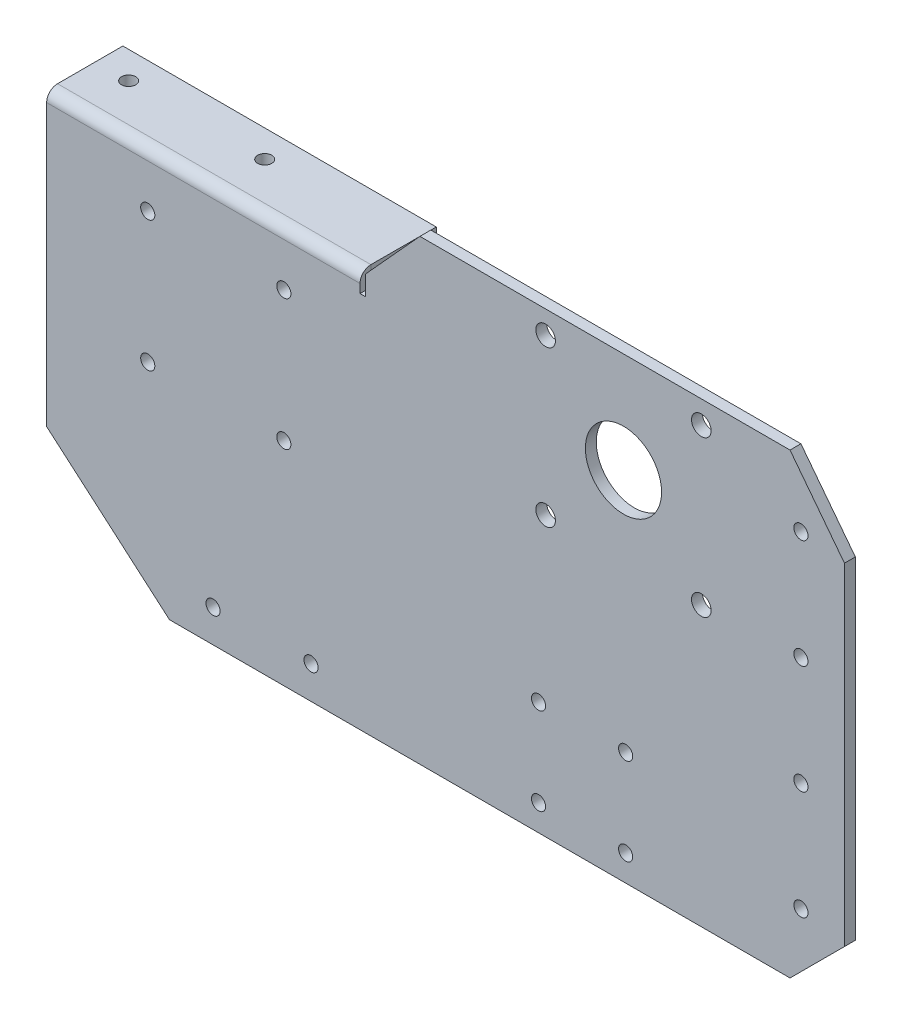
from build123d import *

# Parameters (mm, degrees)
ESQUISSE1_R                  = 6.5
ESQUISSE1_R_2                = 9
ESQUISSE1_R_3                = 35
BASE_EXTRUSION_DEPTH         = 10
BOSS_EXTRU_1_DEPTH           = 10
ESQUISSE3_R                  = 6.5
ENL_V_MAT_EXTRU_1_DEPTH      = 882.375856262
CONG_1_R                     = 10
ENL_V_MAT_EXTRU_2_DEPTH      = 906.537166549
ENL_V_MAT_EXTRU_2_DEPTH_BACK = 906.537166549


with BuildPart() as part:
    # Esquisse1 → Base-Extrusion (new body)
    with BuildSketch(Plane.XY):
        Polygon((749.999, -0.001), (179.999, -0.001), (-0.001, 154.999), (-0.001, 364.999), (354.999, 364.999), (354.999, 346.999), (359.999, 346.999), (359.999, 364.999), (409.999, 419.999), (749.999, 419.999), (799.999, 354.999), (799.999, 49.999), align=None)
        with Locations((759.999, 359.999)):
            Circle(ESQUISSE1_R, mode=Mode.SUBTRACT)
        with Locations((668.499, 398.999)):
            Circle(ESQUISSE1_R_2, mode=Mode.SUBTRACT)
        with Locations((668.499, 255.999)):
            Circle(ESQUISSE1_R_2, mode=Mode.SUBTRACT)
        with Locations((525.499, 398.999)):
            Circle(ESQUISSE1_R_2, mode=Mode.SUBTRACT)
        with Locations((525.499, 255.999)):
            Circle(ESQUISSE1_R_2, mode=Mode.SUBTRACT)
        with Locations((759.999, 259.999)):
            Circle(ESQUISSE1_R, mode=Mode.SUBTRACT)
        with Locations((596.999, 327.499)):
            Circle(ESQUISSE1_R_3, mode=Mode.SUBTRACT)
        with Locations((598.999, 103.999)):
            Circle(ESQUISSE1_R, mode=Mode.SUBTRACT)
        with Locations((598.999, 23.999)):
            Circle(ESQUISSE1_R, mode=Mode.SUBTRACT)
        with Locations((518.999, 103.999)):
            Circle(ESQUISSE1_R, mode=Mode.SUBTRACT)
        with Locations((518.999, 23.999)):
            Circle(ESQUISSE1_R, mode=Mode.SUBTRACT)
        with Locations((309.999, 29.999)):
            Circle(ESQUISSE1_R, mode=Mode.SUBTRACT)
        with Locations((219.999, 29.999)):
            Circle(ESQUISSE1_R, mode=Mode.SUBTRACT)
        with Locations((34.999, 194.999)):
            Circle(ESQUISSE1_R, mode=Mode.SUBTRACT)
        with Locations((159.999, 194.999)):
            Circle(ESQUISSE1_R, mode=Mode.SUBTRACT)
        with Locations((284.999, 194.999)):
            Circle(ESQUISSE1_R, mode=Mode.SUBTRACT)
        with Locations((34.999, 314.999)):
            Circle(ESQUISSE1_R, mode=Mode.SUBTRACT)
        with Locations((159.999, 314.999)):
            Circle(ESQUISSE1_R, mode=Mode.SUBTRACT)
        with Locations((284.999, 314.999)):
            Circle(ESQUISSE1_R, mode=Mode.SUBTRACT)
        with Locations((759.999, 159.999)):
            Circle(ESQUISSE1_R, mode=Mode.SUBTRACT)
        with Locations((759.999, 59.999)):
            Circle(ESQUISSE1_R, mode=Mode.SUBTRACT)
    extrude(amount=BASE_EXTRUSION_DEPTH)

    # Esquisse2 → Boss.-Extru.1 (add)
    with BuildSketch(Plane(origin=(0, 364.999, 0), x_dir=(-1, 0, 0), z_dir=(0, 1, 0))):
        Polygon((-354.961758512, 10), (0.065076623, 10), (0.065076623, -60), (-355.074197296, -60), align=None)
    extrude(amount=-BOSS_EXTRU_1_DEPTH)

    # Esquisse3 → Enl_v. mat.-Extru.1 (cut, through all)
    with BuildSketch(Plane(origin=(0, 364.999, 0), x_dir=(-1, 0, 0), z_dir=(0, 1, 0))):
        with Locations((-97.434923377, -35)):
            Circle(ESQUISSE3_R)
        with Locations((-222.434923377, -35)):
            Circle(ESQUISSE3_R)
    extrude(amount=-ENL_V_MAT_EXTRU_1_DEPTH, mode=Mode.SUBTRACT)

    # Cong_1
    cong_1_edges = [part.edges().sort_by_distance(p)[0] for p in [
        (177.488410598, 354.999, 0),
        (177.466961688, 364.999, 10),
    ]]
    fillet(cong_1_edges, radius=CONG_1_R)

    # Esquisse6 → Enl_v. mat.-Extru.2 (cut, two sides: drawn at the far end of the back side and taken through both)
    with BuildSketch(Plane(origin=(0, 0, 0), x_dir=(-1, 0, 0), z_dir=(0, 0, -1)).offset(-ENL_V_MAT_EXTRU_2_DEPTH_BACK)):
        Polygon((-1757.463619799, 879.229650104), (-64.499, 459.303132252), (26.463129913, 436.740693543), (26.463129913, 111.841576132), (-67.142826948, 97.180704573), (-67.142826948, 459.303132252), (-67.142826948, 2203.57016579), (-2218.646760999, 4949.640222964), (-3908.967553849, 3625.299707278), align=None)
    extrude(amount=ENL_V_MAT_EXTRU_2_DEPTH + ENL_V_MAT_EXTRU_2_DEPTH_BACK, mode=Mode.SUBTRACT)


with BuildPart() as enl_v_mat_extru_2_kept_piece:
    # of the separate pieces the step leaves, the one the design keeps (enl_v_mat_extru_2_pieces_kept)
    add(part.part.solids().sort_by_distance((354.999, 364.999, 0))[0])


solid = enl_v_mat_extru_2_kept_piece.part
